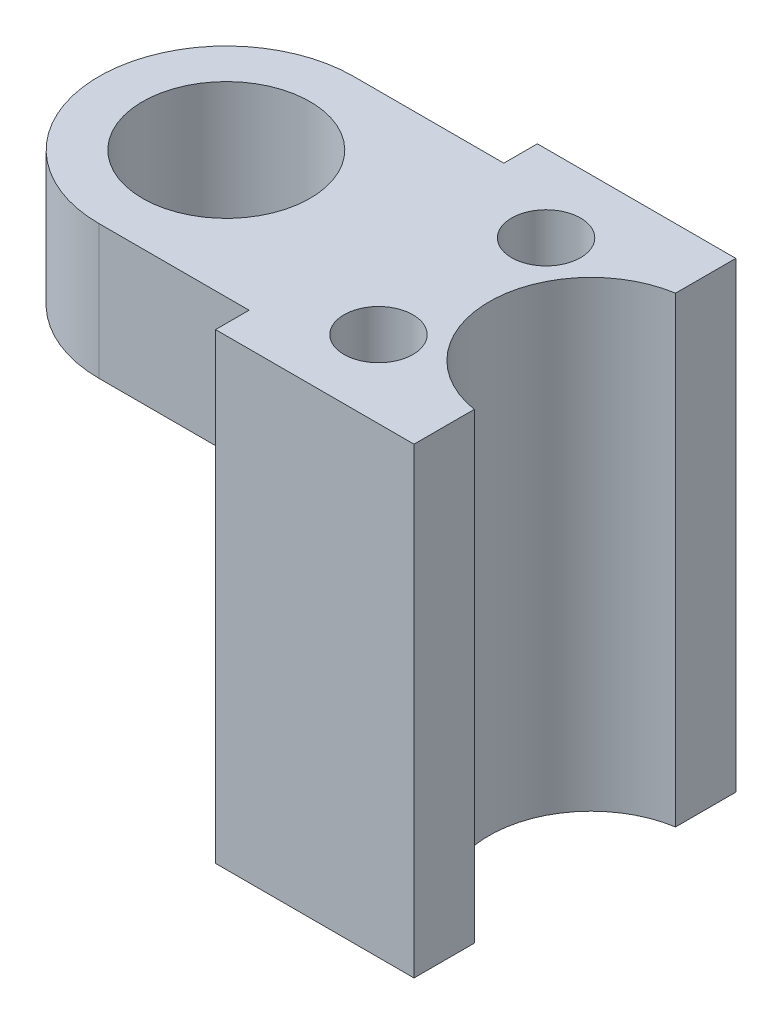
ISO-10303-21;
HEADER;
FILE_DESCRIPTION(('STEP AP214'),'2;1');
FILE_NAME('part.step','',(''),(''),'','','');
FILE_SCHEMA(('AUTOMOTIVE_DESIGN { 1 0 10303 214 1 1 1 1 }'));
ENDSEC;
DATA;
#1=APPLICATION_CONTEXT('core data for automotive mechanical design processes');
#2=APPLICATION_PROTOCOL_DEFINITION('international standard','automotive_design',2000,#1);
#3=PRODUCT_CONTEXT('',#1,'mechanical');
#4=PRODUCT('Part','Part','',(#3));
#5=PRODUCT_RELATED_PRODUCT_CATEGORY('part','',(#4));
#6=PRODUCT_DEFINITION_FORMATION('','',#4);
#7=PRODUCT_DEFINITION_CONTEXT('part definition',#1,'design');
#8=PRODUCT_DEFINITION('design','',#6,#7);
#9=PRODUCT_DEFINITION_SHAPE('','',#8);
#10=(LENGTH_UNIT() NAMED_UNIT(*) SI_UNIT(.MILLI.,.METRE.));
#11=(NAMED_UNIT(*) PLANE_ANGLE_UNIT() SI_UNIT($,.RADIAN.));
#12=(NAMED_UNIT(*) SI_UNIT($,.STERADIAN.) SOLID_ANGLE_UNIT());
#13=UNCERTAINTY_MEASURE_WITH_UNIT(LENGTH_MEASURE(1.E-05),#10,'distance_accuracy_value','');
#14=(GEOMETRIC_REPRESENTATION_CONTEXT(3) GLOBAL_UNCERTAINTY_ASSIGNED_CONTEXT((#13)) GLOBAL_UNIT_ASSIGNED_CONTEXT((#10,
#11,#12)) REPRESENTATION_CONTEXT('',''));
#15=CARTESIAN_POINT('',(0.,0.,0.));
#16=DIRECTION('',(0.,0.,1.));
#17=DIRECTION('',(1.,0.,0.));
#18=AXIS2_PLACEMENT_3D('',#15,#16,#17);
#19=CARTESIAN_POINT('',(8.255,21.8948,0.));
#20=DIRECTION('',(1.,0.,0.));
#21=DIRECTION('',(0.,0.,-1.));
#22=AXIS2_PLACEMENT_3D('',#19,#20,#21);
#23=PLANE('',#22);
#24=DIRECTION('',(0.,1.,0.));
#25=VECTOR('',#24,1.);
#26=CARTESIAN_POINT('',(8.255,0.,-4.7654624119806));
#27=LINE('',#26,#25);
#28=CARTESIAN_POINT('',(8.255,0.,-4.7654624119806));
#29=VERTEX_POINT('',#28);
#30=CARTESIAN_POINT('',(8.255,21.8948,-4.7654624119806));
#31=VERTEX_POINT('',#30);
#32=EDGE_CURVE('E160',#29,#31,#27,.T.);
#33=ORIENTED_EDGE('',*,*,#32,.F.);
#34=DIRECTION('',(0.,0.,1.));
#35=VECTOR('',#34,1.);
#36=CARTESIAN_POINT('',(8.255,0.,0.));
#37=LINE('',#36,#35);
#38=CARTESIAN_POINT('',(8.255,0.,-7.62));
#39=VERTEX_POINT('',#38);
#40=EDGE_CURVE('E197',#39,#29,#37,.T.);
#41=ORIENTED_EDGE('',*,*,#40,.F.);
#42=DIRECTION('',(0.,-1.,0.));
#43=VECTOR('',#42,1.);
#44=CARTESIAN_POINT('',(8.255,21.8948,-7.62));
#45=LINE('',#44,#43);
#46=CARTESIAN_POINT('',(8.255,21.8948,-7.62));
#47=VERTEX_POINT('',#46);
#48=EDGE_CURVE('E43',#47,#39,#45,.T.);
#49=ORIENTED_EDGE('',*,*,#48,.F.);
#50=DIRECTION('',(0.,0.,1.));
#51=VECTOR('',#50,1.);
#52=CARTESIAN_POINT('',(8.255,21.8948,0.));
#53=LINE('',#52,#51);
#54=EDGE_CURVE('E190',#47,#31,#53,.T.);
#55=ORIENTED_EDGE('',*,*,#54,.T.);
#56=EDGE_LOOP('',(#33,#41,#49,#55));
#57=FACE_BOUND('',#56,.T.);
#58=ADVANCED_FACE('F34',(#57),#23,.T.);
#59=CARTESIAN_POINT('',(0.,21.8948,7.62));
#60=DIRECTION('',(0.,0.,-1.));
#61=DIRECTION('',(-1.,0.,0.));
#62=AXIS2_PLACEMENT_3D('',#59,#60,#61);
#63=PLANE('',#62);
#64=DIRECTION('',(1.,0.,0.));
#65=VECTOR('',#64,1.);
#66=CARTESIAN_POINT('',(0.,21.8948,7.62));
#67=LINE('',#66,#65);
#68=CARTESIAN_POINT('',(-1.143,21.8948,7.62));
#69=VERTEX_POINT('',#68);
#70=CARTESIAN_POINT('',(8.255,21.8948,7.62));
#71=VERTEX_POINT('',#70);
#72=EDGE_CURVE('E186',#69,#71,#67,.T.);
#73=ORIENTED_EDGE('',*,*,#72,.F.);
#74=DIRECTION('',(0.,-1.,0.));
#75=VECTOR('',#74,1.);
#76=CARTESIAN_POINT('',(-1.143,15.5448,7.62));
#77=LINE('',#76,#75);
#78=CARTESIAN_POINT('',(-1.143,0.,7.62));
#79=VERTEX_POINT('',#78);
#80=EDGE_CURVE('E181',#69,#79,#77,.T.);
#81=ORIENTED_EDGE('',*,*,#80,.T.);
#82=DIRECTION('',(1.,0.,0.));
#83=VECTOR('',#82,1.);
#84=CARTESIAN_POINT('',(0.,0.,7.62));
#85=LINE('',#84,#83);
#86=CARTESIAN_POINT('',(8.255,0.,7.62));
#87=VERTEX_POINT('',#86);
#88=EDGE_CURVE('E184',#79,#87,#85,.T.);
#89=ORIENTED_EDGE('',*,*,#88,.T.);
#90=DIRECTION('',(0.,-1.,0.));
#91=VECTOR('',#90,1.);
#92=CARTESIAN_POINT('',(8.255,21.8948,7.62));
#93=LINE('',#92,#91);
#94=EDGE_CURVE('E11',#71,#87,#93,.T.);
#95=ORIENTED_EDGE('',*,*,#94,.F.);
#96=EDGE_LOOP('',(#73,#81,#89,#95));
#97=FACE_BOUND('',#96,.T.);
#98=ADVANCED_FACE('F36',(#97),#63,.F.);
#99=DIRECTION('',(0.,1.,0.));
#100=VECTOR('',#99,1.);
#101=CARTESIAN_POINT('',(8.255,0.,4.7654624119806));
#102=LINE('',#101,#100);
#103=CARTESIAN_POINT('',(8.255,21.8948,4.7654624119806));
#104=VERTEX_POINT('',#103);
#105=CARTESIAN_POINT('',(8.255,0.,4.7654624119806));
#106=VERTEX_POINT('',#105);
#107=EDGE_CURVE('E58',#104,#106,#102,.F.);
#108=ORIENTED_EDGE('',*,*,#107,.F.);
#109=EDGE_CURVE('E188',#104,#71,#53,.T.);
#110=ORIENTED_EDGE('',*,*,#109,.T.);
#111=ORIENTED_EDGE('',*,*,#94,.T.);
#112=EDGE_CURVE('E196',#106,#87,#37,.T.);
#113=ORIENTED_EDGE('',*,*,#112,.F.);
#114=EDGE_LOOP('',(#108,#110,#111,#113));
#115=FACE_BOUND('',#114,.T.);
#116=ADVANCED_FACE('F222',(#115),#23,.T.);
#117=CARTESIAN_POINT('',(0.,21.8948,-7.62));
#118=DIRECTION('',(0.,0.,-1.));
#119=DIRECTION('',(-1.,0.,0.));
#120=AXIS2_PLACEMENT_3D('',#117,#118,#119);
#121=PLANE('',#120);
#122=DIRECTION('',(0.,-1.,0.));
#123=VECTOR('',#122,1.);
#124=CARTESIAN_POINT('',(-1.143,15.5448,-7.62));
#125=LINE('',#124,#123);
#126=CARTESIAN_POINT('',(-1.143,21.8948,-7.62));
#127=VERTEX_POINT('',#126);
#128=CARTESIAN_POINT('',(-1.143,0.,-7.62));
#129=VERTEX_POINT('',#128);
#130=EDGE_CURVE('E178',#127,#129,#125,.T.);
#131=ORIENTED_EDGE('',*,*,#130,.F.);
#132=DIRECTION('',(1.,0.,0.));
#133=VECTOR('',#132,1.);
#134=CARTESIAN_POINT('',(0.,21.8948,-7.62));
#135=LINE('',#134,#133);
#136=EDGE_CURVE('E133',#127,#47,#135,.T.);
#137=ORIENTED_EDGE('',*,*,#136,.T.);
#138=ORIENTED_EDGE('',*,*,#48,.T.);
#139=DIRECTION('',(1.,0.,0.));
#140=VECTOR('',#139,1.);
#141=CARTESIAN_POINT('',(0.,0.,-7.62));
#142=LINE('',#141,#140);
#143=EDGE_CURVE('E189',#129,#39,#142,.T.);
#144=ORIENTED_EDGE('',*,*,#143,.F.);
#145=EDGE_LOOP('',(#131,#137,#138,#144));
#146=FACE_BOUND('',#145,.T.);
#147=ADVANCED_FACE('F206',(#146),#121,.T.);
#148=CARTESIAN_POINT('',(0.,21.8948,0.));
#149=DIRECTION('',(0.,1.,0.));
#150=DIRECTION('',(0.,0.,1.));
#151=AXIS2_PLACEMENT_3D('',#148,#149,#150);
#152=PLANE('',#151);
#153=DIRECTION('',(0.,0.,1.));
#154=VECTOR('',#153,1.);
#155=CARTESIAN_POINT('',(-1.143,21.8948,-6.0325));
#156=LINE('',#155,#154);
#157=CARTESIAN_POINT('',(-1.143,21.8948,-6.0325));
#158=VERTEX_POINT('',#157);
#159=EDGE_CURVE('E115',#127,#158,#156,.T.);
#160=ORIENTED_EDGE('',*,*,#159,.T.);
#161=DIRECTION('',(-1.,0.,0.));
#162=VECTOR('',#161,1.);
#163=CARTESIAN_POINT('',(-1.143,21.8948,-6.0325));
#164=LINE('',#163,#162);
#165=CARTESIAN_POINT('',(-8.255,21.8948,-6.0325));
#166=VERTEX_POINT('',#165);
#167=EDGE_CURVE('E123',#158,#166,#164,.T.);
#168=ORIENTED_EDGE('',*,*,#167,.T.);
#169=CARTESIAN_POINT('',(-8.255,21.8948,0.));
#170=DIRECTION('',(0.,1.,0.));
#171=DIRECTION('',(0.,0.,1.));
#172=AXIS2_PLACEMENT_3D('',#169,#170,#171);
#173=CIRCLE('',#172,6.0325);
#174=CARTESIAN_POINT('',(-8.255,21.8948,6.0325));
#175=VERTEX_POINT('',#174);
#176=EDGE_CURVE('E128',#166,#175,#173,.T.);
#177=ORIENTED_EDGE('',*,*,#176,.T.);
#178=DIRECTION('',(1.,0.,0.));
#179=VECTOR('',#178,1.);
#180=CARTESIAN_POINT('',(-1.143,21.8948,6.0325));
#181=LINE('',#180,#179);
#182=CARTESIAN_POINT('',(-1.143,21.8948,6.0325));
#183=VERTEX_POINT('',#182);
#184=EDGE_CURVE('E141',#175,#183,#181,.T.);
#185=ORIENTED_EDGE('',*,*,#184,.T.);
#186=DIRECTION('',(0.,0.,1.));
#187=VECTOR('',#186,1.);
#188=CARTESIAN_POINT('',(-1.143,21.8948,6.0325));
#189=LINE('',#188,#187);
#190=EDGE_CURVE('E120',#183,#69,#189,.T.);
#191=ORIENTED_EDGE('',*,*,#190,.T.);
#192=ORIENTED_EDGE('',*,*,#72,.T.);
#193=ORIENTED_EDGE('',*,*,#109,.F.);
#194=CARTESIAN_POINT('',(9.017,21.8948,0.));
#195=DIRECTION('',(0.,1.,0.));
#196=DIRECTION('',(0.,0.,1.));
#197=AXIS2_PLACEMENT_3D('',#194,#195,#196);
#198=CIRCLE('',#197,4.826);
#199=EDGE_CURVE('E152',#31,#104,#198,.T.);
#200=ORIENTED_EDGE('',*,*,#199,.F.);
#201=ORIENTED_EDGE('',*,*,#54,.F.);
#202=ORIENTED_EDGE('',*,*,#136,.F.);
#203=EDGE_LOOP('',(#160,#168,#177,#185,#191,#192,#193,#200,#201,#202));
#204=FACE_BOUND('',#203,.T.);
#205=CARTESIAN_POINT('',(2.921,21.8948,-3.96875));
#206=DIRECTION('',(0.,1.,0.));
#207=DIRECTION('',(0.,0.,1.));
#208=AXIS2_PLACEMENT_3D('',#205,#206,#207);
#209=CIRCLE('',#208,1.63194999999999);
#210=CARTESIAN_POINT('',(2.921,21.8948,-2.33680000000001));
#211=VERTEX_POINT('',#210);
#212=EDGE_CURVE('E162',#211,#211,#209,.T.);
#213=ORIENTED_EDGE('',*,*,#212,.F.);
#214=EDGE_LOOP('',(#213));
#215=FACE_BOUND('',#214,.T.);
#216=CARTESIAN_POINT('',(2.921,21.8948,3.96875));
#217=DIRECTION('',(0.,1.,0.));
#218=DIRECTION('',(0.,0.,1.));
#219=AXIS2_PLACEMENT_3D('',#216,#217,#218);
#220=CIRCLE('',#219,1.63194999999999);
#221=CARTESIAN_POINT('',(2.921,21.8948,5.60069999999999));
#222=VERTEX_POINT('',#221);
#223=EDGE_CURVE('E168',#222,#222,#220,.T.);
#224=ORIENTED_EDGE('',*,*,#223,.F.);
#225=EDGE_LOOP('',(#224));
#226=FACE_BOUND('',#225,.T.);
#227=CARTESIAN_POINT('',(-8.255,21.8948,0.));
#228=DIRECTION('',(0.,1.,0.));
#229=DIRECTION('',(0.,0.,1.));
#230=AXIS2_PLACEMENT_3D('',#227,#228,#229);
#231=CIRCLE('',#230,3.96875);
#232=CARTESIAN_POINT('',(-8.255,21.8948,3.96875));
#233=VERTEX_POINT('',#232);
#234=EDGE_CURVE('E174',#233,#233,#231,.T.);
#235=ORIENTED_EDGE('',*,*,#234,.F.);
#236=EDGE_LOOP('',(#235));
#237=FACE_BOUND('',#236,.T.);
#238=ADVANCED_FACE('F130',(#204,#215,#226,#237),#152,.T.);
#239=CARTESIAN_POINT('',(0.,0.,0.));
#240=DIRECTION('',(0.,1.,0.));
#241=DIRECTION('',(0.,0.,1.));
#242=AXIS2_PLACEMENT_3D('',#239,#240,#241);
#243=PLANE('',#242);
#244=CARTESIAN_POINT('',(2.921,0.,-3.96875));
#245=DIRECTION('',(0.,1.,0.));
#246=DIRECTION('',(0.,0.,1.));
#247=AXIS2_PLACEMENT_3D('',#244,#245,#246);
#248=CIRCLE('',#247,1.63194999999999);
#249=CARTESIAN_POINT('',(2.921,0.,-2.33680000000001));
#250=VERTEX_POINT('',#249);
#251=EDGE_CURVE('E165',#250,#250,#248,.T.);
#252=ORIENTED_EDGE('',*,*,#251,.T.);
#253=EDGE_LOOP('',(#252));
#254=FACE_BOUND('',#253,.T.);
#255=CARTESIAN_POINT('',(2.921,0.,3.96875));
#256=DIRECTION('',(0.,1.,0.));
#257=DIRECTION('',(0.,0.,1.));
#258=AXIS2_PLACEMENT_3D('',#255,#256,#257);
#259=CIRCLE('',#258,1.63194999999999);
#260=CARTESIAN_POINT('',(2.921,0.,5.60069999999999));
#261=VERTEX_POINT('',#260);
#262=EDGE_CURVE('E171',#261,#261,#259,.T.);
#263=ORIENTED_EDGE('',*,*,#262,.T.);
#264=EDGE_LOOP('',(#263));
#265=FACE_BOUND('',#264,.T.);
#266=ORIENTED_EDGE('',*,*,#40,.T.);
#267=CARTESIAN_POINT('',(9.017,0.,0.));
#268=DIRECTION('',(0.,1.,0.));
#269=DIRECTION('',(0.,0.,1.));
#270=AXIS2_PLACEMENT_3D('',#267,#268,#269);
#271=CIRCLE('',#270,4.826);
#272=EDGE_CURVE('E156',#29,#106,#271,.T.);
#273=ORIENTED_EDGE('',*,*,#272,.T.);
#274=ORIENTED_EDGE('',*,*,#112,.T.);
#275=ORIENTED_EDGE('',*,*,#88,.F.);
#276=DIRECTION('',(0.,0.,1.));
#277=VECTOR('',#276,1.);
#278=CARTESIAN_POINT('',(-1.143,0.,-7.62));
#279=LINE('',#278,#277);
#280=EDGE_CURVE('E179',#129,#79,#279,.T.);
#281=ORIENTED_EDGE('',*,*,#280,.F.);
#282=ORIENTED_EDGE('',*,*,#143,.T.);
#283=EDGE_LOOP('',(#266,#273,#274,#275,#281,#282));
#284=FACE_BOUND('',#283,.T.);
#285=ADVANCED_FACE('F210',(#254,#265,#284),#243,.F.);
#286=CARTESIAN_POINT('',(-1.143,15.5448,-7.62));
#287=DIRECTION('',(1.,0.,0.));
#288=DIRECTION('',(0.,0.,-1.));
#289=AXIS2_PLACEMENT_3D('',#286,#287,#288);
#290=PLANE('',#289);
#291=ORIENTED_EDGE('',*,*,#280,.T.);
#292=ORIENTED_EDGE('',*,*,#80,.F.);
#293=ORIENTED_EDGE('',*,*,#190,.F.);
#294=DIRECTION('',(0.,-1.,0.));
#295=VECTOR('',#294,1.);
#296=CARTESIAN_POINT('',(-1.143,21.8948,6.0325));
#297=LINE('',#296,#295);
#298=CARTESIAN_POINT('',(-1.143,15.5448,6.0325));
#299=VERTEX_POINT('',#298);
#300=EDGE_CURVE('E150',#183,#299,#297,.T.);
#301=ORIENTED_EDGE('',*,*,#300,.T.);
#302=DIRECTION('',(0.,0.,1.));
#303=VECTOR('',#302,1.);
#304=CARTESIAN_POINT('',(-1.143,15.5448,-7.62));
#305=LINE('',#304,#303);
#306=CARTESIAN_POINT('',(-1.143,15.5448,-6.0325));
#307=VERTEX_POINT('',#306);
#308=EDGE_CURVE('E118',#307,#299,#305,.T.);
#309=ORIENTED_EDGE('',*,*,#308,.F.);
#310=DIRECTION('',(0.,-1.,0.));
#311=VECTOR('',#310,1.);
#312=CARTESIAN_POINT('',(-1.143,21.8948,-6.0325));
#313=LINE('',#312,#311);
#314=EDGE_CURVE('E50',#158,#307,#313,.T.);
#315=ORIENTED_EDGE('',*,*,#314,.F.);
#316=ORIENTED_EDGE('',*,*,#159,.F.);
#317=ORIENTED_EDGE('',*,*,#130,.T.);
#318=EDGE_LOOP('',(#291,#292,#293,#301,#309,#315,#316,#317));
#319=FACE_BOUND('',#318,.T.);
#320=ADVANCED_FACE('F113',(#319),#290,.F.);
#321=CARTESIAN_POINT('',(-8.255,15.5448,0.));
#322=DIRECTION('',(0.,1.,0.));
#323=DIRECTION('',(0.,0.,1.));
#324=AXIS2_PLACEMENT_3D('',#321,#322,#323);
#325=PLANE('',#324);
#326=CARTESIAN_POINT('',(-8.255,15.5448,0.));
#327=DIRECTION('',(0.,1.,0.));
#328=DIRECTION('',(0.,0.,1.));
#329=AXIS2_PLACEMENT_3D('',#326,#327,#328);
#330=CIRCLE('',#329,3.96875);
#331=CARTESIAN_POINT('',(-8.255,15.5448,3.96875));
#332=VERTEX_POINT('',#331);
#333=EDGE_CURVE('E38',#332,#332,#330,.T.);
#334=ORIENTED_EDGE('',*,*,#333,.T.);
#335=EDGE_LOOP('',(#334));
#336=FACE_BOUND('',#335,.T.);
#337=ORIENTED_EDGE('',*,*,#308,.T.);
#338=DIRECTION('',(1.,0.,0.));
#339=VECTOR('',#338,1.);
#340=CARTESIAN_POINT('',(-1.143,15.5448,6.0325));
#341=LINE('',#340,#339);
#342=CARTESIAN_POINT('',(-8.255,15.5448,6.0325));
#343=VERTEX_POINT('',#342);
#344=EDGE_CURVE('E134',#343,#299,#341,.T.);
#345=ORIENTED_EDGE('',*,*,#344,.F.);
#346=CARTESIAN_POINT('',(-8.255,15.5448,0.));
#347=DIRECTION('',(0.,1.,0.));
#348=DIRECTION('',(0.,0.,1.));
#349=AXIS2_PLACEMENT_3D('',#346,#347,#348);
#350=CIRCLE('',#349,6.0325);
#351=CARTESIAN_POINT('',(-8.255,15.5448,-6.0325));
#352=VERTEX_POINT('',#351);
#353=EDGE_CURVE('E137',#352,#343,#350,.T.);
#354=ORIENTED_EDGE('',*,*,#353,.F.);
#355=DIRECTION('',(-1.,0.,0.));
#356=VECTOR('',#355,1.);
#357=CARTESIAN_POINT('',(-1.143,15.5448,-6.0325));
#358=LINE('',#357,#356);
#359=EDGE_CURVE('E146',#307,#352,#358,.T.);
#360=ORIENTED_EDGE('',*,*,#359,.F.);
#361=EDGE_LOOP('',(#337,#345,#354,#360));
#362=FACE_BOUND('',#361,.T.);
#363=ADVANCED_FACE('F270',(#336,#362),#325,.F.);
#364=CARTESIAN_POINT('',(-8.255,0.,0.));
#365=DIRECTION('',(0.,1.,0.));
#366=DIRECTION('',(0.,0.,1.));
#367=AXIS2_PLACEMENT_3D('',#364,#365,#366);
#368=CYLINDRICAL_SURFACE('',#367,3.96875);
#369=ORIENTED_EDGE('',*,*,#234,.T.);
#370=EDGE_LOOP('',(#369));
#371=FACE_BOUND('',#370,.T.);
#372=ORIENTED_EDGE('',*,*,#333,.F.);
#373=EDGE_LOOP('',(#372));
#374=FACE_BOUND('',#373,.T.);
#375=ADVANCED_FACE('F281',(#371,#374),#368,.F.);
#376=CARTESIAN_POINT('',(2.921,21.8948,3.96875));
#377=DIRECTION('',(0.,1.,0.));
#378=DIRECTION('',(0.,0.,1.));
#379=AXIS2_PLACEMENT_3D('',#376,#377,#378);
#380=CYLINDRICAL_SURFACE('',#379,1.63194999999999);
#381=ORIENTED_EDGE('',*,*,#262,.F.);
#382=EDGE_LOOP('',(#381));
#383=FACE_BOUND('',#382,.T.);
#384=ORIENTED_EDGE('',*,*,#223,.T.);
#385=EDGE_LOOP('',(#384));
#386=FACE_BOUND('',#385,.T.);
#387=ADVANCED_FACE('F321',(#383,#386),#380,.F.);
#388=CARTESIAN_POINT('',(2.921,21.8948,-3.96875));
#389=DIRECTION('',(0.,1.,0.));
#390=DIRECTION('',(0.,0.,1.));
#391=AXIS2_PLACEMENT_3D('',#388,#389,#390);
#392=CYLINDRICAL_SURFACE('',#391,1.63194999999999);
#393=ORIENTED_EDGE('',*,*,#251,.F.);
#394=EDGE_LOOP('',(#393));
#395=FACE_BOUND('',#394,.T.);
#396=ORIENTED_EDGE('',*,*,#212,.T.);
#397=EDGE_LOOP('',(#396));
#398=FACE_BOUND('',#397,.T.);
#399=ADVANCED_FACE('F318',(#395,#398),#392,.F.);
#400=CARTESIAN_POINT('',(9.017,0.,0.));
#401=DIRECTION('',(0.,1.,0.));
#402=DIRECTION('',(0.,0.,1.));
#403=AXIS2_PLACEMENT_3D('',#400,#401,#402);
#404=CYLINDRICAL_SURFACE('',#403,4.826);
#405=ORIENTED_EDGE('',*,*,#32,.T.);
#406=ORIENTED_EDGE('',*,*,#199,.T.);
#407=ORIENTED_EDGE('',*,*,#107,.T.);
#408=ORIENTED_EDGE('',*,*,#272,.F.);
#409=EDGE_LOOP('',(#405,#406,#407,#408));
#410=FACE_BOUND('',#409,.T.);
#411=ADVANCED_FACE('F244',(#410),#404,.F.);
#412=CARTESIAN_POINT('',(-1.143,21.8948,6.0325));
#413=DIRECTION('',(0.,0.,-1.));
#414=DIRECTION('',(-1.,0.,0.));
#415=AXIS2_PLACEMENT_3D('',#412,#413,#414);
#416=PLANE('',#415);
#417=ORIENTED_EDGE('',*,*,#344,.T.);
#418=ORIENTED_EDGE('',*,*,#300,.F.);
#419=ORIENTED_EDGE('',*,*,#184,.F.);
#420=DIRECTION('',(0.,-1.,0.));
#421=VECTOR('',#420,1.);
#422=CARTESIAN_POINT('',(-8.255,21.8948,6.0325));
#423=LINE('',#422,#421);
#424=EDGE_CURVE('E153',#175,#343,#423,.T.);
#425=ORIENTED_EDGE('',*,*,#424,.T.);
#426=EDGE_LOOP('',(#417,#418,#419,#425));
#427=FACE_BOUND('',#426,.T.);
#428=ADVANCED_FACE('F290',(#427),#416,.F.);
#429=CARTESIAN_POINT('',(-8.255,21.8948,0.));
#430=DIRECTION('',(0.,-1.,0.));
#431=DIRECTION('',(0.,0.,-1.));
#432=AXIS2_PLACEMENT_3D('',#429,#430,#431);
#433=CYLINDRICAL_SURFACE('',#432,6.0325);
#434=ORIENTED_EDGE('',*,*,#353,.T.);
#435=ORIENTED_EDGE('',*,*,#424,.F.);
#436=ORIENTED_EDGE('',*,*,#176,.F.);
#437=DIRECTION('',(0.,-1.,0.));
#438=VECTOR('',#437,1.);
#439=CARTESIAN_POINT('',(-8.255,21.8948,-6.0325));
#440=LINE('',#439,#438);
#441=EDGE_CURVE('E119',#166,#352,#440,.T.);
#442=ORIENTED_EDGE('',*,*,#441,.T.);
#443=EDGE_LOOP('',(#434,#435,#436,#442));
#444=FACE_BOUND('',#443,.T.);
#445=ADVANCED_FACE('F294',(#444),#433,.T.);
#446=CARTESIAN_POINT('',(-1.143,21.8948,-6.0325));
#447=DIRECTION('',(0.,0.,1.));
#448=DIRECTION('',(1.,0.,0.));
#449=AXIS2_PLACEMENT_3D('',#446,#447,#448);
#450=PLANE('',#449);
#451=ORIENTED_EDGE('',*,*,#359,.T.);
#452=ORIENTED_EDGE('',*,*,#441,.F.);
#453=ORIENTED_EDGE('',*,*,#167,.F.);
#454=ORIENTED_EDGE('',*,*,#314,.T.);
#455=EDGE_LOOP('',(#451,#452,#453,#454));
#456=FACE_BOUND('',#455,.T.);
#457=ADVANCED_FACE('F124',(#456),#450,.F.);
#458=CLOSED_SHELL('',(#58,#98,#116,#147,#238,#285,#320,#363,#375,#387,#399,#411,#428,#445,#457));
#459=MANIFOLD_SOLID_BREP('B2',#458);
#460=ADVANCED_BREP_SHAPE_REPRESENTATION('',(#18,#459),#14);
#461=SHAPE_DEFINITION_REPRESENTATION(#9,#460);
ENDSEC;
END-ISO-10303-21;
